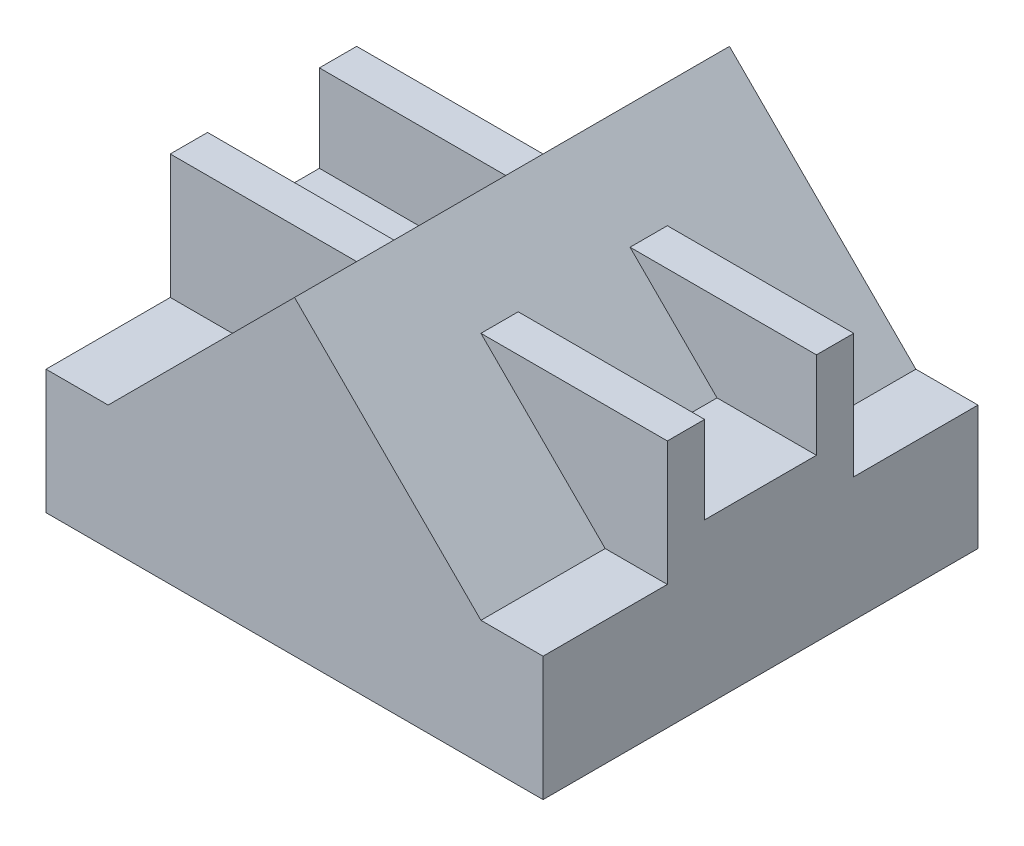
from build123d import *

# Parameters (mm, degrees)
SKETCH2_W           = 200
SKETCH2_H           = 175
BOSS_EXTRUDE1_DEPTH = 50
BOSS_EXTRUDE2_DEPTH = 200
BOSS_EXTRUDE3_DEPTH = 175


with BuildPart() as part:
    # Sketch2 → Boss-Extrude1 (new body)
    with BuildSketch(Plane(origin=(0, 0, 0), x_dir=(1, 0, 0), z_dir=(0, 1, 0))):
        Rectangle(SKETCH2_W, SKETCH2_H)
    extrude(amount=BOSS_EXTRUDE1_DEPTH)

    # Sketch3 → Boss-Extrude2 (add)
    with BuildSketch(Plane(origin=(100, 0, 0), x_dir=(0, 0, -1), z_dir=(1, 0, 0))):
        Polygon((-37.5, 50), (-37.5, 100), (-22.5, 100), (-22.5, 65), (22.5, 65), (22.5, 100), (37.5, 100), (37.5, 50), (87.5, 50), (87.5, 0), (-87.5, 0), (-87.5, 50), align=None)
    extrude(amount=-BOSS_EXTRUDE2_DEPTH)

    # Sketch5 → Boss-Extrude3 (add, through all)
    with BuildSketch(Plane.XY.offset(87.5)):
        Polygon((75, 50), (0, 125), (-75, 50), (-100, 50), (-100, 0), (100, 0), (100, 50), align=None)
    extrude(amount=-BOSS_EXTRUDE3_DEPTH)


solid = part.part
